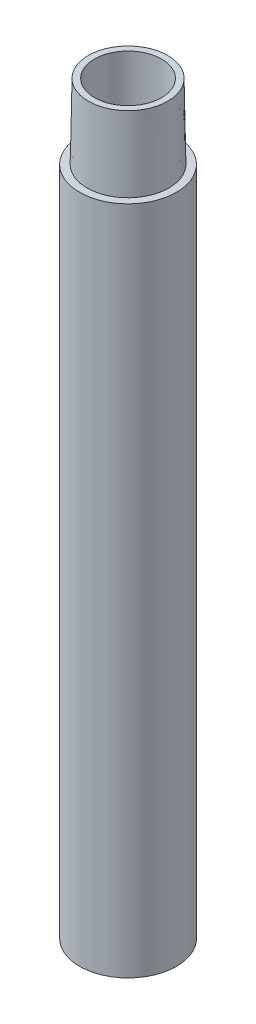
from build123d import *

# Parameters (mm, degrees)
D_POUILLE1_ANGLE = 1


with BuildPart() as part:
    # Esquisse1 → R_volution9 (revolve)
    with BuildSketch(Plane.XY, mode=Mode.PRIVATE) as r_volution9_sk:
        Polygon((65, -919.506010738), (65, -19.506010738), (55, -19.506010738), (55, 80.493989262), (45, 80.493989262), (45, -29.506010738), (55, -29.506010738), (55, -919.506010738), align=None)
    revolve(r_volution9_sk.sketch.rotate(Axis((0, -969.506010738, 0), (0, 1, 0)), 90), axis=Axis((0, -969.506010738, 0), (0, 1, 0)))

    # D_pouille1
    d_pouille1_faces = [part.faces().sort_by_distance(p)[0] for p in [
        (0, 30.493989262, 55),
    ]]
    draft(d_pouille1_faces, Plane(origin=(65, -19.506010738, 0), x_dir=(0, 0, 1), z_dir=(0, 1, 0)), D_POUILLE1_ANGLE)


solid = part.part
